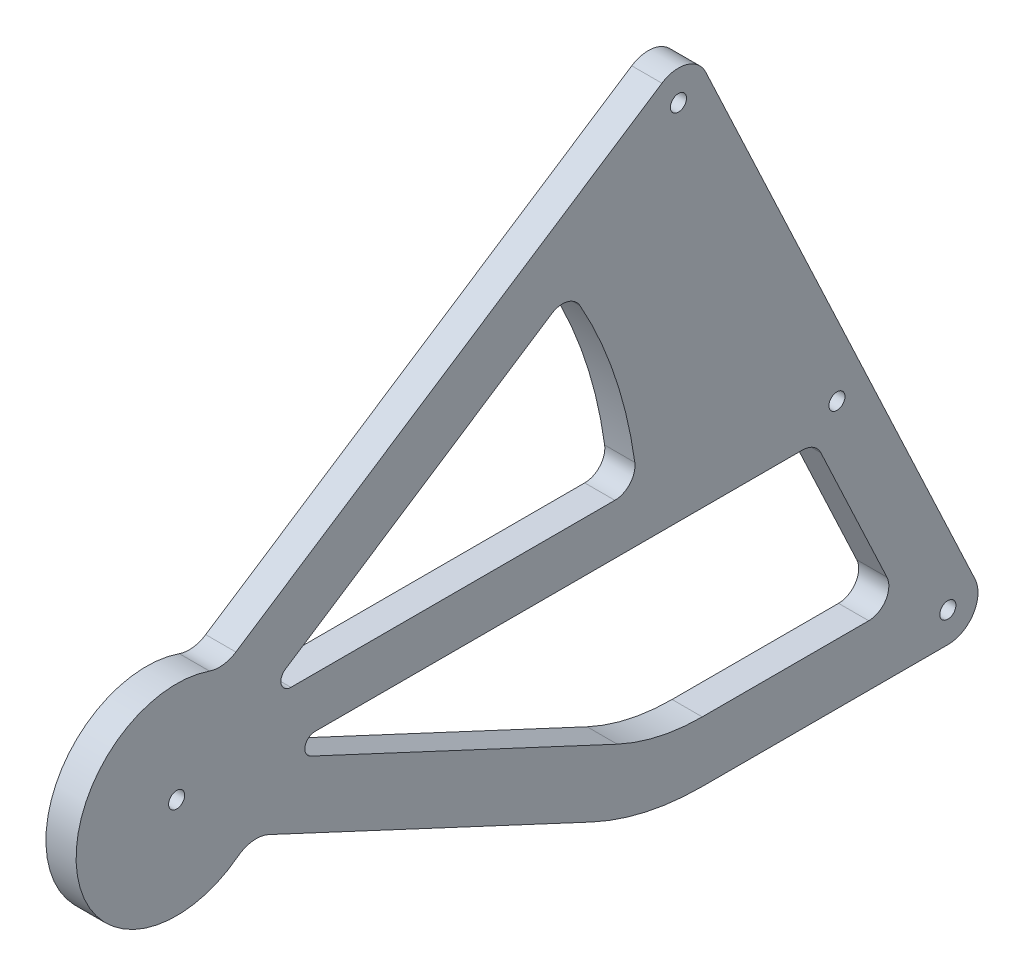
ISO-10303-21;
HEADER;
FILE_DESCRIPTION(('STEP AP214'),'2;1');
FILE_NAME('part.step','',(''),(''),'','','');
FILE_SCHEMA(('AUTOMOTIVE_DESIGN { 1 0 10303 214 1 1 1 1 }'));
ENDSEC;
DATA;
#1=APPLICATION_CONTEXT('core data for automotive mechanical design processes');
#2=APPLICATION_PROTOCOL_DEFINITION('international standard','automotive_design',2000,#1);
#3=PRODUCT_CONTEXT('',#1,'mechanical');
#4=PRODUCT('Part','Part','',(#3));
#5=PRODUCT_RELATED_PRODUCT_CATEGORY('part','',(#4));
#6=PRODUCT_DEFINITION_FORMATION('','',#4);
#7=PRODUCT_DEFINITION_CONTEXT('part definition',#1,'design');
#8=PRODUCT_DEFINITION('design','',#6,#7);
#9=PRODUCT_DEFINITION_SHAPE('','',#8);
#10=(LENGTH_UNIT() NAMED_UNIT(*) SI_UNIT(.MILLI.,.METRE.));
#11=(NAMED_UNIT(*) PLANE_ANGLE_UNIT() SI_UNIT($,.RADIAN.));
#12=(NAMED_UNIT(*) SI_UNIT($,.STERADIAN.) SOLID_ANGLE_UNIT());
#13=UNCERTAINTY_MEASURE_WITH_UNIT(LENGTH_MEASURE(1.E-05),#10,'distance_accuracy_value','');
#14=(GEOMETRIC_REPRESENTATION_CONTEXT(3) GLOBAL_UNCERTAINTY_ASSIGNED_CONTEXT((#13)) GLOBAL_UNIT_ASSIGNED_CONTEXT((#10,
#11,#12)) REPRESENTATION_CONTEXT('',''));
#15=CARTESIAN_POINT('',(0.,0.,0.));
#16=DIRECTION('',(0.,0.,1.));
#17=DIRECTION('',(1.,0.,0.));
#18=AXIS2_PLACEMENT_3D('',#15,#16,#17);
#19=CARTESIAN_POINT('',(15.,9147.56718383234,-4265.58063130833));
#20=DIRECTION('',(0.,0.906307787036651,-0.422618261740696));
#21=DIRECTION('',(0.,0.422618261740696,0.906307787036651));
#22=AXIS2_PLACEMENT_3D('',#19,#20,#21);
#23=PLANE('',#22);
#24=DIRECTION('',(0.,-0.422618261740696,-0.906307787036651));
#25=VECTOR('',#24,1.);
#26=CARTESIAN_POINT('',(15.,9147.56718383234,-4265.58063130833));
#27=LINE('',#26,#25);
#28=CARTESIAN_POINT('',(15.,4531.6365922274,-14164.475729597));
#29=VERTEX_POINT('',#28);
#30=CARTESIAN_POINT('',(15.,4456.78055450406,-14325.0050205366));
#31=VERTEX_POINT('',#30);
#32=EDGE_CURVE('E264',#29,#31,#27,.T.);
#33=ORIENTED_EDGE('',*,*,#32,.F.);
#34=DIRECTION('',(1.,0.,0.));
#35=VECTOR('',#34,1.);
#36=CARTESIAN_POINT('',(0.,4531.6365922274,-14164.475729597));
#37=LINE('',#36,#35);
#38=CARTESIAN_POINT('',(0.,4531.6365922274,-14164.475729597));
#39=VERTEX_POINT('',#38);
#40=EDGE_CURVE('E343',#29,#39,#37,.F.);
#41=ORIENTED_EDGE('',*,*,#40,.T.);
#42=DIRECTION('',(0.,-0.422618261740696,-0.906307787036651));
#43=VECTOR('',#42,1.);
#44=CARTESIAN_POINT('',(0.,9147.56718383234,-4265.58063130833));
#45=LINE('',#44,#43);
#46=CARTESIAN_POINT('',(0.,4456.78055450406,-14325.0050205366));
#47=VERTEX_POINT('',#46);
#48=EDGE_CURVE('E322',#39,#47,#45,.T.);
#49=ORIENTED_EDGE('',*,*,#48,.T.);
#50=DIRECTION('',(-1.,0.,0.));
#51=VECTOR('',#50,1.);
#52=CARTESIAN_POINT('',(15.,4456.78055450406,-14325.0050205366));
#53=LINE('',#52,#51);
#54=EDGE_CURVE('E339',#31,#47,#53,.T.);
#55=ORIENTED_EDGE('',*,*,#54,.F.);
#56=EDGE_LOOP('',(#33,#41,#49,#55));
#57=FACE_BOUND('',#56,.T.);
#58=ADVANCED_FACE('F37',(#57),#23,.F.);
#59=CARTESIAN_POINT('',(15.,4574.60056681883,-14379.9453945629));
#60=DIRECTION('',(-1.,0.,0.));
#61=DIRECTION('',(0.,0.,1.));
#62=AXIS2_PLACEMENT_3D('',#59,#60,#61);
#63=CYLINDRICAL_SURFACE('',#62,130.000000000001);
#64=CARTESIAN_POINT('',(0.,4574.60056681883,-14379.9453945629));
#65=DIRECTION('',(1.,0.,0.));
#66=DIRECTION('',(0.,0.,-1.));
#67=AXIS2_PLACEMENT_3D('',#64,#65,#66);
#68=CIRCLE('',#67,130.000000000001);
#69=CARTESIAN_POINT('',(0.,4444.60056681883,-14379.9453945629));
#70=VERTEX_POINT('',#69);
#71=EDGE_CURVE('E324',#47,#70,#68,.T.);
#72=ORIENTED_EDGE('',*,*,#71,.T.);
#73=DIRECTION('',(-1.,0.,0.));
#74=VECTOR('',#73,1.);
#75=CARTESIAN_POINT('',(15.,4444.60056681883,-14379.9453945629));
#76=LINE('',#75,#74);
#77=CARTESIAN_POINT('',(15.,4444.60056681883,-14379.9453945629));
#78=VERTEX_POINT('',#77);
#79=EDGE_CURVE('E336',#78,#70,#76,.T.);
#80=ORIENTED_EDGE('',*,*,#79,.F.);
#81=CARTESIAN_POINT('',(15.,4574.60056681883,-14379.9453945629));
#82=DIRECTION('',(1.,0.,0.));
#83=DIRECTION('',(0.,0.,-1.));
#84=AXIS2_PLACEMENT_3D('',#81,#82,#83);
#85=CIRCLE('',#84,130.000000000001);
#86=EDGE_CURVE('E266',#31,#78,#85,.T.);
#87=ORIENTED_EDGE('',*,*,#86,.F.);
#88=ORIENTED_EDGE('',*,*,#54,.T.);
#89=EDGE_LOOP('',(#72,#80,#87,#88));
#90=FACE_BOUND('',#89,.T.);
#91=ADVANCED_FACE('F422',(#90),#63,.T.);
#92=CARTESIAN_POINT('',(15.,4444.60056681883,0.));
#93=DIRECTION('',(0.,1.,0.));
#94=DIRECTION('',(0.,0.,1.));
#95=AXIS2_PLACEMENT_3D('',#92,#93,#94);
#96=PLANE('',#95);
#97=DIRECTION('',(0.,0.,-1.));
#98=VECTOR('',#97,1.);
#99=CARTESIAN_POINT('',(0.,4444.60056681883,0.));
#100=LINE('',#99,#98);
#101=CARTESIAN_POINT('',(0.,4444.60056681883,-14502.0941967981));
#102=VERTEX_POINT('',#101);
#103=EDGE_CURVE('E326',#70,#102,#100,.T.);
#104=ORIENTED_EDGE('',*,*,#103,.T.);
#105=DIRECTION('',(-1.,0.,0.));
#106=VECTOR('',#105,1.);
#107=CARTESIAN_POINT('',(15.,4444.60056681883,-14502.0941967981));
#108=LINE('',#107,#106);
#109=CARTESIAN_POINT('',(15.,4444.60056681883,-14502.0941967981));
#110=VERTEX_POINT('',#109);
#111=EDGE_CURVE('E52',#102,#110,#108,.F.);
#112=ORIENTED_EDGE('',*,*,#111,.T.);
#113=DIRECTION('',(0.,0.,-1.));
#114=VECTOR('',#113,1.);
#115=CARTESIAN_POINT('',(15.,4444.60056681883,0.));
#116=LINE('',#115,#114);
#117=EDGE_CURVE('E268',#78,#110,#116,.T.);
#118=ORIENTED_EDGE('',*,*,#117,.F.);
#119=ORIENTED_EDGE('',*,*,#79,.T.);
#120=EDGE_LOOP('',(#104,#112,#118,#119));
#121=FACE_BOUND('',#120,.T.);
#122=ADVANCED_FACE('F448',(#121),#96,.F.);
#123=CARTESIAN_POINT('',(15.,6390.02329246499,-13612.4779994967));
#124=DIRECTION('',(0.,0.42493399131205,-0.905224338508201));
#125=DIRECTION('',(0.,0.905224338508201,0.42493399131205));
#126=AXIS2_PLACEMENT_3D('',#123,#124,#125);
#127=PLANE('',#126);
#128=DIRECTION('',(0.,-0.905224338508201,-0.42493399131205));
#129=VECTOR('',#128,1.);
#130=CARTESIAN_POINT('',(0.,6390.02329246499,-13612.4779994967));
#131=LINE('',#130,#129);
#132=CARTESIAN_POINT('',(0.,4751.36103589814,-14381.7053208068));
#133=VERTEX_POINT('',#132);
#134=CARTESIAN_POINT('',(0.,4465.97457668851,-14515.6725618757));
#135=VERTEX_POINT('',#134);
#136=EDGE_CURVE('E328',#133,#135,#131,.T.);
#137=ORIENTED_EDGE('',*,*,#136,.F.);
#138=DIRECTION('',(-1.,0.,0.));
#139=VECTOR('',#138,1.);
#140=CARTESIAN_POINT('',(15.,4751.36103589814,-14381.7053208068));
#141=LINE('',#140,#139);
#142=CARTESIAN_POINT('',(15.,4751.36103589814,-14381.7053208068));
#143=VERTEX_POINT('',#142);
#144=EDGE_CURVE('E385',#133,#143,#141,.F.);
#145=ORIENTED_EDGE('',*,*,#144,.T.);
#146=DIRECTION('',(0.,-0.905224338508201,-0.42493399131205));
#147=VECTOR('',#146,1.);
#148=CARTESIAN_POINT('',(15.,6390.02329246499,-13612.4779994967));
#149=LINE('',#148,#147);
#150=CARTESIAN_POINT('',(15.,4465.97457668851,-14515.6725618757));
#151=VERTEX_POINT('',#150);
#152=EDGE_CURVE('E270',#143,#151,#149,.T.);
#153=ORIENTED_EDGE('',*,*,#152,.T.);
#154=DIRECTION('',(-1.,0.,0.));
#155=VECTOR('',#154,1.);
#156=CARTESIAN_POINT('',(0.,4465.97457668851,-14515.6725618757));
#157=LINE('',#156,#155);
#158=EDGE_CURVE('E382',#151,#135,#157,.T.);
#159=ORIENTED_EDGE('',*,*,#158,.T.);
#160=EDGE_LOOP('',(#137,#145,#153,#159));
#161=FACE_BOUND('',#160,.T.);
#162=ADVANCED_FACE('F428',(#161),#127,.T.);
#163=CARTESIAN_POINT('',(15.,-3261.01811935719,-2139.80590851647));
#164=DIRECTION('',(0.,0.836075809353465,0.548613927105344));
#165=DIRECTION('',(0.,-0.548613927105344,0.836075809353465));
#166=AXIS2_PLACEMENT_3D('',#163,#164,#165);
#167=PLANE('',#166);
#168=DIRECTION('',(0.,0.548613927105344,-0.836075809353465));
#169=VECTOR('',#168,1.);
#170=CARTESIAN_POINT('',(0.,-3261.01811935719,-2139.80590851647));
#171=LINE('',#170,#169);
#172=CARTESIAN_POINT('',(0.,4618.494719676,-14148.0137733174));
#173=VERTEX_POINT('',#172);
#174=CARTESIAN_POINT('',(0.,4757.52816316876,-14359.8977468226));
#175=VERTEX_POINT('',#174);
#176=EDGE_CURVE('E331',#173,#175,#171,.T.);
#177=ORIENTED_EDGE('',*,*,#176,.F.);
#178=DIRECTION('',(-1.,0.,0.));
#179=VECTOR('',#178,1.);
#180=CARTESIAN_POINT('',(15.,4618.494719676,-14148.0137733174));
#181=LINE('',#180,#179);
#182=CARTESIAN_POINT('',(15.,4618.494719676,-14148.0137733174));
#183=VERTEX_POINT('',#182);
#184=EDGE_CURVE('E376',#173,#183,#181,.F.);
#185=ORIENTED_EDGE('',*,*,#184,.T.);
#186=DIRECTION('',(0.,0.548613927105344,-0.836075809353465));
#187=VECTOR('',#186,1.);
#188=CARTESIAN_POINT('',(15.,-3261.01811935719,-2139.80590851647));
#189=LINE('',#188,#187);
#190=CARTESIAN_POINT('',(15.,4757.52816316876,-14359.8977468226));
#191=VERTEX_POINT('',#190);
#192=EDGE_CURVE('E272',#183,#191,#189,.T.);
#193=ORIENTED_EDGE('',*,*,#192,.T.);
#194=DIRECTION('',(-1.,0.,0.));
#195=VECTOR('',#194,1.);
#196=CARTESIAN_POINT('',(15.,4757.52816316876,-14359.8977468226));
#197=LINE('',#196,#195);
#198=EDGE_CURVE('E373',#191,#175,#197,.T.);
#199=ORIENTED_EDGE('',*,*,#198,.T.);
#200=EDGE_LOOP('',(#177,#185,#193,#199));
#201=FACE_BOUND('',#200,.T.);
#202=ADVANCED_FACE('F402',(#201),#167,.T.);
#203=CARTESIAN_POINT('',(15.,4559.60056681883,-14187.3238479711));
#204=DIRECTION('',(-1.,0.,0.));
#205=DIRECTION('',(0.,0.,1.));
#206=AXIS2_PLACEMENT_3D('',#203,#204,#205);
#207=CYLINDRICAL_SURFACE('',#206,4.9999999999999);
#208=CARTESIAN_POINT('',(0.,4559.60056681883,-14187.3238479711));
#209=DIRECTION('',(1.,0.,0.));
#210=DIRECTION('',(0.,0.,-1.));
#211=AXIS2_PLACEMENT_3D('',#208,#209,#210);
#212=CIRCLE('',#211,4.9999999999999);
#213=CARTESIAN_POINT('',(0.,4564.60056681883,-14187.3238479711));
#214=VERTEX_POINT('',#213);
#215=CARTESIAN_POINT('',(0.,4555.06902788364,-14185.2107566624));
#216=VERTEX_POINT('',#215);
#217=EDGE_CURVE('E298',#214,#216,#212,.T.);
#218=ORIENTED_EDGE('',*,*,#217,.F.);
#219=DIRECTION('',(-1.,0.,0.));
#220=VECTOR('',#219,1.);
#221=CARTESIAN_POINT('',(15.,4564.60056681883,-14187.3238479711));
#222=LINE('',#221,#220);
#223=CARTESIAN_POINT('',(15.,4564.60056681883,-14187.3238479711));
#224=VERTEX_POINT('',#223);
#225=EDGE_CURVE('E340',#224,#214,#222,.T.);
#226=ORIENTED_EDGE('',*,*,#225,.F.);
#227=CARTESIAN_POINT('',(15.,4559.60056681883,-14187.3238479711));
#228=DIRECTION('',(1.,0.,0.));
#229=DIRECTION('',(0.,0.,-1.));
#230=AXIS2_PLACEMENT_3D('',#227,#228,#229);
#231=CIRCLE('',#230,4.9999999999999);
#232=CARTESIAN_POINT('',(15.,4555.06902788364,-14185.2107566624));
#233=VERTEX_POINT('',#232);
#234=EDGE_CURVE('E242',#224,#233,#231,.T.);
#235=ORIENTED_EDGE('',*,*,#234,.T.);
#236=DIRECTION('',(-1.,0.,0.));
#237=VECTOR('',#236,1.);
#238=CARTESIAN_POINT('',(15.,4555.06902788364,-14185.2107566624));
#239=LINE('',#238,#237);
#240=EDGE_CURVE('E211',#233,#216,#239,.T.);
#241=ORIENTED_EDGE('',*,*,#240,.T.);
#242=EDGE_LOOP('',(#218,#226,#235,#241));
#243=FACE_BOUND('',#242,.T.);
#244=ADVANCED_FACE('F481',(#243),#207,.F.);
#245=CARTESIAN_POINT('',(15.,4564.60056681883,0.));
#246=DIRECTION('',(0.,1.,0.));
#247=DIRECTION('',(0.,0.,1.));
#248=AXIS2_PLACEMENT_3D('',#245,#246,#247);
#249=PLANE('',#248);
#250=DIRECTION('',(0.,0.,-1.));
#251=VECTOR('',#250,1.);
#252=CARTESIAN_POINT('',(0.,4564.60056681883,0.));
#253=LINE('',#252,#251);
#254=CARTESIAN_POINT('',(0.,4564.60056681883,-14429.8814574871));
#255=VERTEX_POINT('',#254);
#256=EDGE_CURVE('E301',#214,#255,#253,.T.);
#257=ORIENTED_EDGE('',*,*,#256,.T.);
#258=DIRECTION('',(-1.,0.,0.));
#259=VECTOR('',#258,1.);
#260=CARTESIAN_POINT('',(15.,4564.60056681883,-14429.8814574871));
#261=LINE('',#260,#259);
#262=CARTESIAN_POINT('',(15.,4564.60056681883,-14429.8814574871));
#263=VERTEX_POINT('',#262);
#264=EDGE_CURVE('E355',#263,#255,#261,.T.);
#265=ORIENTED_EDGE('',*,*,#264,.F.);
#266=DIRECTION('',(0.,0.,-1.));
#267=VECTOR('',#266,1.);
#268=CARTESIAN_POINT('',(15.,4564.60056681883,0.));
#269=LINE('',#268,#267);
#270=EDGE_CURVE('E245',#224,#263,#269,.T.);
#271=ORIENTED_EDGE('',*,*,#270,.F.);
#272=ORIENTED_EDGE('',*,*,#225,.T.);
#273=EDGE_LOOP('',(#257,#265,#271,#272));
#274=FACE_BOUND('',#273,.T.);
#275=ADVANCED_FACE('F477',(#274),#249,.F.);
#276=CARTESIAN_POINT('',(15.,4554.60056681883,-14429.8814574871));
#277=DIRECTION('',(-1.,0.,0.));
#278=DIRECTION('',(0.,0.,1.));
#279=AXIS2_PLACEMENT_3D('',#276,#277,#278);
#280=CYLINDRICAL_SURFACE('',#279,9.99999999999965);
#281=CARTESIAN_POINT('',(0.,4554.60056681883,-14429.8814574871));
#282=DIRECTION('',(1.,0.,0.));
#283=DIRECTION('',(0.,0.,-1.));
#284=AXIS2_PLACEMENT_3D('',#281,#282,#283);
#285=CIRCLE('',#284,9.99999999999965);
#286=CARTESIAN_POINT('',(0.,4558.84990673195,-14438.9337008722));
#287=VERTEX_POINT('',#286);
#288=EDGE_CURVE('E304',#287,#255,#285,.T.);
#289=ORIENTED_EDGE('',*,*,#288,.F.);
#290=DIRECTION('',(-1.,0.,0.));
#291=VECTOR('',#290,1.);
#292=CARTESIAN_POINT('',(15.,4558.84990673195,-14438.9337008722));
#293=LINE('',#292,#291);
#294=CARTESIAN_POINT('',(15.,4558.84990673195,-14438.9337008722));
#295=VERTEX_POINT('',#294);
#296=EDGE_CURVE('E353',#295,#287,#293,.T.);
#297=ORIENTED_EDGE('',*,*,#296,.F.);
#298=CARTESIAN_POINT('',(15.,4554.60056681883,-14429.8814574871));
#299=DIRECTION('',(1.,0.,0.));
#300=DIRECTION('',(0.,0.,-1.));
#301=AXIS2_PLACEMENT_3D('',#298,#299,#300);
#302=CIRCLE('',#301,9.99999999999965);
#303=EDGE_CURVE('E247',#295,#263,#302,.T.);
#304=ORIENTED_EDGE('',*,*,#303,.T.);
#305=ORIENTED_EDGE('',*,*,#264,.T.);
#306=EDGE_LOOP('',(#289,#297,#304,#305));
#307=FACE_BOUND('',#306,.T.);
#308=ADVANCED_FACE('F473',(#307),#280,.F.);
#309=CARTESIAN_POINT('',(15.,6377.27527272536,-13585.3212693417));
#310=DIRECTION('',(0.,0.424933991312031,-0.90522433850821));
#311=DIRECTION('',(0.,0.90522433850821,0.424933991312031));
#312=AXIS2_PLACEMENT_3D('',#309,#310,#311);
#313=PLANE('',#312);
#314=DIRECTION('',(0.,-0.90522433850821,-0.424933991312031));
#315=VECTOR('',#314,1.);
#316=CARTESIAN_POINT('',(0.,6377.27527272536,-13585.3212693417));
#317=LINE('',#316,#315);
#318=CARTESIAN_POINT('',(0.,4488.84990673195,-14471.7933778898));
#319=VERTEX_POINT('',#318);
#320=EDGE_CURVE('E307',#287,#319,#317,.T.);
#321=ORIENTED_EDGE('',*,*,#320,.T.);
#322=DIRECTION('',(-1.,0.,0.));
#323=VECTOR('',#322,1.);
#324=CARTESIAN_POINT('',(15.,4488.84990673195,-14471.7933778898));
#325=LINE('',#324,#323);
#326=CARTESIAN_POINT('',(15.,4488.84990673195,-14471.7933778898));
#327=VERTEX_POINT('',#326);
#328=EDGE_CURVE('E351',#327,#319,#325,.T.);
#329=ORIENTED_EDGE('',*,*,#328,.F.);
#330=DIRECTION('',(0.,-0.90522433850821,-0.424933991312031));
#331=VECTOR('',#330,1.);
#332=CARTESIAN_POINT('',(15.,6377.27527272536,-13585.3212693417));
#333=LINE('',#332,#331);
#334=EDGE_CURVE('E250',#295,#327,#333,.T.);
#335=ORIENTED_EDGE('',*,*,#334,.F.);
#336=ORIENTED_EDGE('',*,*,#296,.T.);
#337=EDGE_LOOP('',(#321,#329,#335,#336));
#338=FACE_BOUND('',#337,.T.);
#339=ADVANCED_FACE('F469',(#338),#313,.F.);
#340=CARTESIAN_POINT('',(15.,4484.60056681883,-14462.7411345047));
#341=DIRECTION('',(-1.,0.,0.));
#342=DIRECTION('',(0.,0.,1.));
#343=AXIS2_PLACEMENT_3D('',#340,#341,#342);
#344=CYLINDRICAL_SURFACE('',#343,9.99999999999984);
#345=CARTESIAN_POINT('',(0.,4484.60056681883,-14462.7411345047));
#346=DIRECTION('',(1.,0.,0.));
#347=DIRECTION('',(0.,0.,-1.));
#348=AXIS2_PLACEMENT_3D('',#345,#346,#347);
#349=CIRCLE('',#348,9.99999999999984);
#350=CARTESIAN_POINT('',(0.,4474.60056681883,-14462.7411345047));
#351=VERTEX_POINT('',#350);
#352=EDGE_CURVE('E310',#351,#319,#349,.T.);
#353=ORIENTED_EDGE('',*,*,#352,.F.);
#354=DIRECTION('',(-1.,0.,0.));
#355=VECTOR('',#354,1.);
#356=CARTESIAN_POINT('',(15.,4474.60056681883,-14462.7411345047));
#357=LINE('',#356,#355);
#358=CARTESIAN_POINT('',(15.,4474.60056681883,-14462.7411345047));
#359=VERTEX_POINT('',#358);
#360=EDGE_CURVE('E349',#359,#351,#357,.T.);
#361=ORIENTED_EDGE('',*,*,#360,.F.);
#362=CARTESIAN_POINT('',(15.,4484.60056681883,-14462.7411345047));
#363=DIRECTION('',(1.,0.,0.));
#364=DIRECTION('',(0.,0.,-1.));
#365=AXIS2_PLACEMENT_3D('',#362,#363,#364);
#366=CIRCLE('',#365,9.99999999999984);
#367=EDGE_CURVE('E252',#359,#327,#366,.T.);
#368=ORIENTED_EDGE('',*,*,#367,.T.);
#369=ORIENTED_EDGE('',*,*,#328,.T.);
#370=EDGE_LOOP('',(#353,#361,#368,#369));
#371=FACE_BOUND('',#370,.T.);
#372=ADVANCED_FACE('F465',(#371),#344,.F.);
#373=CARTESIAN_POINT('',(15.,4474.60056681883,0.));
#374=DIRECTION('',(0.,1.,0.));
#375=DIRECTION('',(0.,0.,1.));
#376=AXIS2_PLACEMENT_3D('',#373,#374,#375);
#377=PLANE('',#376);
#378=DIRECTION('',(0.,0.,-1.));
#379=VECTOR('',#378,1.);
#380=CARTESIAN_POINT('',(0.,4474.60056681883,0.));
#381=LINE('',#380,#379);
#382=CARTESIAN_POINT('',(0.,4474.60056681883,-14379.9453945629));
#383=VERTEX_POINT('',#382);
#384=EDGE_CURVE('E313',#383,#351,#381,.T.);
#385=ORIENTED_EDGE('',*,*,#384,.F.);
#386=DIRECTION('',(-1.,0.,0.));
#387=VECTOR('',#386,1.);
#388=CARTESIAN_POINT('',(15.,4474.60056681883,-14379.9453945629));
#389=LINE('',#388,#387);
#390=CARTESIAN_POINT('',(15.,4474.60056681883,-14379.9453945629));
#391=VERTEX_POINT('',#390);
#392=EDGE_CURVE('E347',#391,#383,#389,.T.);
#393=ORIENTED_EDGE('',*,*,#392,.F.);
#394=DIRECTION('',(0.,0.,-1.));
#395=VECTOR('',#394,1.);
#396=CARTESIAN_POINT('',(15.,4474.60056681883,0.));
#397=LINE('',#396,#395);
#398=EDGE_CURVE('E255',#391,#359,#397,.T.);
#399=ORIENTED_EDGE('',*,*,#398,.T.);
#400=ORIENTED_EDGE('',*,*,#360,.T.);
#401=EDGE_LOOP('',(#385,#393,#399,#400));
#402=FACE_BOUND('',#401,.T.);
#403=ADVANCED_FACE('F461',(#402),#377,.T.);
#404=CARTESIAN_POINT('',(15.,4574.60056681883,-14379.9453945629));
#405=DIRECTION('',(-1.,0.,0.));
#406=DIRECTION('',(0.,0.,1.));
#407=AXIS2_PLACEMENT_3D('',#404,#405,#406);
#408=CYLINDRICAL_SURFACE('',#407,100.000000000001);
#409=CARTESIAN_POINT('',(0.,4574.60056681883,-14379.9453945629));
#410=DIRECTION('',(1.,0.,0.));
#411=DIRECTION('',(0.,0.,-1.));
#412=AXIS2_PLACEMENT_3D('',#409,#410,#411);
#413=CIRCLE('',#412,100.000000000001);
#414=CARTESIAN_POINT('',(0.,4483.96978811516,-14337.6835683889));
#415=VERTEX_POINT('',#414);
#416=EDGE_CURVE('E316',#415,#383,#413,.T.);
#417=ORIENTED_EDGE('',*,*,#416,.F.);
#418=DIRECTION('',(-1.,0.,0.));
#419=VECTOR('',#418,1.);
#420=CARTESIAN_POINT('',(15.,4483.96978811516,-14337.6835683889));
#421=LINE('',#420,#419);
#422=CARTESIAN_POINT('',(15.,4483.96978811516,-14337.6835683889));
#423=VERTEX_POINT('',#422);
#424=EDGE_CURVE('E345',#423,#415,#421,.T.);
#425=ORIENTED_EDGE('',*,*,#424,.F.);
#426=CARTESIAN_POINT('',(15.,4574.60056681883,-14379.9453945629));
#427=DIRECTION('',(1.,0.,0.));
#428=DIRECTION('',(0.,0.,-1.));
#429=AXIS2_PLACEMENT_3D('',#426,#427,#428);
#430=CIRCLE('',#429,100.000000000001);
#431=EDGE_CURVE('E258',#423,#391,#430,.T.);
#432=ORIENTED_EDGE('',*,*,#431,.T.);
#433=ORIENTED_EDGE('',*,*,#392,.T.);
#434=EDGE_LOOP('',(#417,#425,#432,#433));
#435=FACE_BOUND('',#434,.T.);
#436=ADVANCED_FACE('F458',(#435),#408,.F.);
#437=CARTESIAN_POINT('',(15.,4594.60056681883,-14175.3967398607));
#438=DIRECTION('',(-1.,0.,0.));
#439=DIRECTION('',(0.,0.,1.));
#440=AXIS2_PLACEMENT_3D('',#437,#438,#439);
#441=CYLINDRICAL_SURFACE('',#440,4.99999999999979);
#442=CARTESIAN_POINT('',(0.,4594.60056681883,-14175.3967398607));
#443=DIRECTION('',(1.,0.,0.));
#444=DIRECTION('',(0.,0.,-1.));
#445=AXIS2_PLACEMENT_3D('',#442,#443,#444);
#446=CIRCLE('',#445,4.99999999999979);
#447=CARTESIAN_POINT('',(0.,4598.78094586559,-14172.6536702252));
#448=VERTEX_POINT('',#447);
#449=CARTESIAN_POINT('',(0.,4589.60056681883,-14175.3967398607));
#450=VERTEX_POINT('',#449);
#451=EDGE_CURVE('E207',#448,#450,#446,.T.);
#452=ORIENTED_EDGE('',*,*,#451,.F.);
#453=DIRECTION('',(-1.,0.,0.));
#454=VECTOR('',#453,1.);
#455=CARTESIAN_POINT('',(15.,4598.78094586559,-14172.6536702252));
#456=LINE('',#455,#454);
#457=CARTESIAN_POINT('',(15.,4598.78094586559,-14172.6536702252));
#458=VERTEX_POINT('',#457);
#459=EDGE_CURVE('E200',#458,#448,#456,.T.);
#460=ORIENTED_EDGE('',*,*,#459,.F.);
#461=CARTESIAN_POINT('',(15.,4594.60056681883,-14175.3967398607));
#462=DIRECTION('',(1.,0.,0.));
#463=DIRECTION('',(0.,0.,-1.));
#464=AXIS2_PLACEMENT_3D('',#461,#462,#463);
#465=CIRCLE('',#464,4.99999999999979);
#466=CARTESIAN_POINT('',(15.,4589.60056681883,-14175.3967398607));
#467=VERTEX_POINT('',#466);
#468=EDGE_CURVE('E204',#458,#467,#465,.T.);
#469=ORIENTED_EDGE('',*,*,#468,.T.);
#470=DIRECTION('',(-1.,0.,0.));
#471=VECTOR('',#470,1.);
#472=CARTESIAN_POINT('',(15.,4589.60056681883,-14175.3967398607));
#473=LINE('',#472,#471);
#474=EDGE_CURVE('E278',#467,#450,#473,.T.);
#475=ORIENTED_EDGE('',*,*,#474,.T.);
#476=EDGE_LOOP('',(#452,#460,#469,#475));
#477=FACE_BOUND('',#476,.T.);
#478=ADVANCED_FACE('F202',(#477),#441,.F.);
#479=CARTESIAN_POINT('',(15.,-3286.10039363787,-2156.26432632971));
#480=DIRECTION('',(0.,0.836075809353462,0.54861392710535));
#481=DIRECTION('',(0.,-0.54861392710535,0.836075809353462));
#482=AXIS2_PLACEMENT_3D('',#479,#480,#481);
#483=PLANE('',#482);
#484=DIRECTION('',(0.,0.54861392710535,-0.836075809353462));
#485=VECTOR('',#484,1.);
#486=CARTESIAN_POINT('',(0.,-3286.10039363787,-2156.26432632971));
#487=LINE('',#486,#485);
#488=CARTESIAN_POINT('',(0.,4685.58757589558,-14304.9451048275));
#489=VERTEX_POINT('',#488);
#490=EDGE_CURVE('E284',#448,#489,#487,.T.);
#491=ORIENTED_EDGE('',*,*,#490,.T.);
#492=DIRECTION('',(-1.,0.,0.));
#493=VECTOR('',#492,1.);
#494=CARTESIAN_POINT('',(15.,4685.58757589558,-14304.9451048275));
#495=LINE('',#494,#493);
#496=CARTESIAN_POINT('',(15.,4685.58757589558,-14304.9451048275));
#497=VERTEX_POINT('',#496);
#498=EDGE_CURVE('E212',#497,#489,#495,.T.);
#499=ORIENTED_EDGE('',*,*,#498,.F.);
#500=DIRECTION('',(0.,0.54861392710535,-0.836075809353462));
#501=VECTOR('',#500,1.);
#502=CARTESIAN_POINT('',(15.,-3286.10039363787,-2156.26432632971));
#503=LINE('',#502,#501);
#504=EDGE_CURVE('E215',#458,#497,#503,.T.);
#505=ORIENTED_EDGE('',*,*,#504,.F.);
#506=ORIENTED_EDGE('',*,*,#459,.T.);
#507=EDGE_LOOP('',(#491,#499,#505,#506));
#508=FACE_BOUND('',#507,.T.);
#509=ADVANCED_FACE('F216',(#508),#483,.F.);
#510=CARTESIAN_POINT('',(15.,4677.22681780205,-14310.4312440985));
#511=DIRECTION('',(-1.,0.,0.));
#512=DIRECTION('',(0.,0.,1.));
#513=AXIS2_PLACEMENT_3D('',#510,#511,#512);
#514=CYLINDRICAL_SURFACE('',#513,10.0000000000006);
#515=CARTESIAN_POINT('',(0.,4677.22681780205,-14310.4312440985));
#516=DIRECTION('',(1.,0.,0.));
#517=DIRECTION('',(0.,0.,-1.));
#518=AXIS2_PLACEMENT_3D('',#515,#516,#517);
#519=CIRCLE('',#518,10.0000000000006);
#520=CARTESIAN_POINT('',(0.,4682.11892011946,-14319.1529030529));
#521=VERTEX_POINT('',#520);
#522=EDGE_CURVE('E286',#521,#489,#519,.T.);
#523=ORIENTED_EDGE('',*,*,#522,.F.);
#524=DIRECTION('',(-1.,0.,0.));
#525=VECTOR('',#524,1.);
#526=CARTESIAN_POINT('',(15.,4682.11892011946,-14319.1529030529));
#527=LINE('',#526,#525);
#528=CARTESIAN_POINT('',(15.,4682.11892011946,-14319.1529030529));
#529=VERTEX_POINT('',#528);
#530=EDGE_CURVE('E363',#529,#521,#527,.T.);
#531=ORIENTED_EDGE('',*,*,#530,.F.);
#532=CARTESIAN_POINT('',(15.,4677.22681780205,-14310.4312440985));
#533=DIRECTION('',(1.,0.,0.));
#534=DIRECTION('',(0.,0.,-1.));
#535=AXIS2_PLACEMENT_3D('',#532,#533,#534);
#536=CIRCLE('',#535,10.0000000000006);
#537=EDGE_CURVE('E220',#529,#497,#536,.T.);
#538=ORIENTED_EDGE('',*,*,#537,.T.);
#539=ORIENTED_EDGE('',*,*,#498,.T.);
#540=EDGE_LOOP('',(#523,#531,#538,#539));
#541=FACE_BOUND('',#540,.T.);
#542=ADVANCED_FACE('F496',(#541),#514,.F.);
#543=CARTESIAN_POINT('',(15.,4569.60056681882,-14118.5547471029));
#544=DIRECTION('',(-1.,0.,0.));
#545=DIRECTION('',(0.,0.,1.));
#546=AXIS2_PLACEMENT_3D('',#543,#544,#545);
#547=CYLINDRICAL_SURFACE('',#546,229.999999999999);
#548=CARTESIAN_POINT('',(0.,4569.60056681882,-14118.5547471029));
#549=DIRECTION('',(1.,0.,0.));
#550=DIRECTION('',(0.,0.,-1.));
#551=AXIS2_PLACEMENT_3D('',#548,#549,#550);
#552=CIRCLE('',#551,229.999999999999);
#553=CARTESIAN_POINT('',(0.,4600.96420318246,-14346.406282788));
#554=VERTEX_POINT('',#553);
#555=EDGE_CURVE('E289',#554,#521,#552,.T.);
#556=ORIENTED_EDGE('',*,*,#555,.F.);
#557=DIRECTION('',(-1.,0.,0.));
#558=VECTOR('',#557,1.);
#559=CARTESIAN_POINT('',(15.,4600.96420318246,-14346.406282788));
#560=LINE('',#559,#558);
#561=CARTESIAN_POINT('',(15.,4600.96420318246,-14346.406282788));
#562=VERTEX_POINT('',#561);
#563=EDGE_CURVE('E361',#562,#554,#560,.T.);
#564=ORIENTED_EDGE('',*,*,#563,.F.);
#565=CARTESIAN_POINT('',(15.,4569.60056681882,-14118.5547471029));
#566=DIRECTION('',(1.,0.,0.));
#567=DIRECTION('',(0.,0.,-1.));
#568=AXIS2_PLACEMENT_3D('',#565,#566,#567);
#569=CIRCLE('',#568,229.999999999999);
#570=EDGE_CURVE('E235',#562,#529,#569,.T.);
#571=ORIENTED_EDGE('',*,*,#570,.T.);
#572=ORIENTED_EDGE('',*,*,#530,.T.);
#573=EDGE_LOOP('',(#556,#564,#571,#572));
#574=FACE_BOUND('',#573,.T.);
#575=ADVANCED_FACE('F492',(#574),#547,.F.);
#576=CARTESIAN_POINT('',(15.,4599.60056681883,-14336.49969428));
#577=DIRECTION('',(-1.,0.,0.));
#578=DIRECTION('',(0.,0.,1.));
#579=AXIS2_PLACEMENT_3D('',#576,#577,#578);
#580=CYLINDRICAL_SURFACE('',#579,9.99999999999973);
#581=CARTESIAN_POINT('',(0.,4599.60056681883,-14336.49969428));
#582=DIRECTION('',(1.,0.,0.));
#583=DIRECTION('',(0.,0.,-1.));
#584=AXIS2_PLACEMENT_3D('',#581,#582,#583);
#585=CIRCLE('',#584,9.99999999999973);
#586=CARTESIAN_POINT('',(0.,4589.60056681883,-14336.49969428));
#587=VERTEX_POINT('',#586);
#588=EDGE_CURVE('E292',#587,#554,#585,.T.);
#589=ORIENTED_EDGE('',*,*,#588,.F.);
#590=DIRECTION('',(-1.,0.,0.));
#591=VECTOR('',#590,1.);
#592=CARTESIAN_POINT('',(15.,4589.60056681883,-14336.49969428));
#593=LINE('',#592,#591);
#594=CARTESIAN_POINT('',(15.,4589.60056681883,-14336.49969428));
#595=VERTEX_POINT('',#594);
#596=EDGE_CURVE('E359',#595,#587,#593,.T.);
#597=ORIENTED_EDGE('',*,*,#596,.F.);
#598=CARTESIAN_POINT('',(15.,4599.60056681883,-14336.49969428));
#599=DIRECTION('',(1.,0.,0.));
#600=DIRECTION('',(0.,0.,-1.));
#601=AXIS2_PLACEMENT_3D('',#598,#599,#600);
#602=CIRCLE('',#601,9.99999999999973);
#603=EDGE_CURVE('E238',#595,#562,#602,.T.);
#604=ORIENTED_EDGE('',*,*,#603,.T.);
#605=ORIENTED_EDGE('',*,*,#563,.T.);
#606=EDGE_LOOP('',(#589,#597,#604,#605));
#607=FACE_BOUND('',#606,.T.);
#608=ADVANCED_FACE('F456',(#607),#580,.F.);
#609=CARTESIAN_POINT('',(15.,9174.75641744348,-4278.25917916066));
#610=DIRECTION('',(0.,0.906307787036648,-0.422618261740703));
#611=DIRECTION('',(0.,0.422618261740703,0.906307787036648));
#612=AXIS2_PLACEMENT_3D('',#609,#610,#611);
#613=PLANE('',#612);
#614=DIRECTION('',(0.,-0.422618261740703,-0.906307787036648));
#615=VECTOR('',#614,1.);
#616=CARTESIAN_POINT('',(0.,9174.75641744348,-4278.25917916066));
#617=LINE('',#616,#615);
#618=EDGE_CURVE('E319',#216,#415,#617,.T.);
#619=ORIENTED_EDGE('',*,*,#618,.F.);
#620=ORIENTED_EDGE('',*,*,#240,.F.);
#621=DIRECTION('',(0.,-0.422618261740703,-0.906307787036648));
#622=VECTOR('',#621,1.);
#623=CARTESIAN_POINT('',(15.,9174.75641744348,-4278.25917916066));
#624=LINE('',#623,#622);
#625=EDGE_CURVE('E261',#233,#423,#624,.T.);
#626=ORIENTED_EDGE('',*,*,#625,.T.);
#627=ORIENTED_EDGE('',*,*,#424,.T.);
#628=EDGE_LOOP('',(#619,#620,#626,#627));
#629=FACE_BOUND('',#628,.T.);
#630=ADVANCED_FACE('F452',(#629),#613,.T.);
#631=CARTESIAN_POINT('',(15.,4589.60056681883,0.));
#632=DIRECTION('',(0.,1.,0.));
#633=DIRECTION('',(0.,0.,1.));
#634=AXIS2_PLACEMENT_3D('',#631,#632,#633);
#635=PLANE('',#634);
#636=DIRECTION('',(0.,0.,-1.));
#637=VECTOR('',#636,1.);
#638=CARTESIAN_POINT('',(0.,4589.60056681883,0.));
#639=LINE('',#638,#637);
#640=EDGE_CURVE('E295',#450,#587,#639,.T.);
#641=ORIENTED_EDGE('',*,*,#640,.F.);
#642=ORIENTED_EDGE('',*,*,#474,.F.);
#643=DIRECTION('',(0.,0.,-1.));
#644=VECTOR('',#643,1.);
#645=CARTESIAN_POINT('',(15.,4589.60056681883,0.));
#646=LINE('',#645,#644);
#647=EDGE_CURVE('E226',#467,#595,#646,.T.);
#648=ORIENTED_EDGE('',*,*,#647,.T.);
#649=ORIENTED_EDGE('',*,*,#596,.T.);
#650=EDGE_LOOP('',(#641,#642,#648,#649));
#651=FACE_BOUND('',#650,.T.);
#652=ADVANCED_FACE('F455',(#651),#635,.T.);
#653=CARTESIAN_POINT('',(15.,4569.60056681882,-14118.5547471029));
#654=DIRECTION('',(-1.,0.,0.));
#655=DIRECTION('',(0.,0.,1.));
#656=AXIS2_PLACEMENT_3D('',#653,#654,#655);
#657=CYLINDRICAL_SURFACE('',#656,3.99999999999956);
#658=CARTESIAN_POINT('',(15.,4569.60056681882,-14118.5547471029));
#659=DIRECTION('',(1.,0.,0.));
#660=DIRECTION('',(0.,0.,-1.));
#661=AXIS2_PLACEMENT_3D('',#658,#659,#660);
#662=CIRCLE('',#661,3.99999999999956);
#663=CARTESIAN_POINT('',(15.,4569.60056681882,-14122.5547471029));
#664=VERTEX_POINT('',#663);
#665=EDGE_CURVE('E227',#664,#664,#662,.T.);
#666=ORIENTED_EDGE('',*,*,#665,.T.);
#667=EDGE_LOOP('',(#666));
#668=FACE_BOUND('',#667,.T.);
#669=CARTESIAN_POINT('',(0.,4569.60056681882,-14118.5547471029));
#670=DIRECTION('',(1.,0.,0.));
#671=DIRECTION('',(0.,0.,-1.));
#672=AXIS2_PLACEMENT_3D('',#669,#670,#671);
#673=CIRCLE('',#672,3.99999999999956);
#674=CARTESIAN_POINT('',(0.,4569.60056681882,-14122.5547471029));
#675=VERTEX_POINT('',#674);
#676=EDGE_CURVE('E279',#675,#675,#673,.T.);
#677=ORIENTED_EDGE('',*,*,#676,.F.);
#678=EDGE_LOOP('',(#677));
#679=FACE_BOUND('',#678,.T.);
#680=ADVANCED_FACE('F488',(#668,#679),#657,.F.);
#681=CARTESIAN_POINT('',(15.,4569.60056681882,-14118.5547471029));
#682=DIRECTION('',(-1.,0.,0.));
#683=DIRECTION('',(0.,0.,1.));
#684=AXIS2_PLACEMENT_3D('',#681,#682,#683);
#685=CYLINDRICAL_SURFACE('',#684,49.9999999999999);
#686=CARTESIAN_POINT('',(0.,4569.60056681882,-14118.5547471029));
#687=DIRECTION('',(1.,0.,0.));
#688=DIRECTION('',(0.,0.,-1.));
#689=AXIS2_PLACEMENT_3D('',#686,#687,#688);
#690=CIRCLE('',#689,49.9999999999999);
#691=CARTESIAN_POINT('',(0.,4616.8584822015,-14134.8853758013));
#692=VERTEX_POINT('',#691);
#693=CARTESIAN_POINT('',(0.,4529.94011189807,-14149.0022152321));
#694=VERTEX_POINT('',#693);
#695=EDGE_CURVE('E230',#692,#694,#690,.T.);
#696=ORIENTED_EDGE('',*,*,#695,.T.);
#697=DIRECTION('',(-1.,0.,0.));
#698=VECTOR('',#697,1.);
#699=CARTESIAN_POINT('',(15.,4529.94011189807,-14149.0022152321));
#700=LINE('',#699,#698);
#701=CARTESIAN_POINT('',(15.,4529.94011189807,-14149.0022152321));
#702=VERTEX_POINT('',#701);
#703=EDGE_CURVE('E371',#694,#702,#700,.F.);
#704=ORIENTED_EDGE('',*,*,#703,.T.);
#705=CARTESIAN_POINT('',(15.,4569.60056681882,-14118.5547471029));
#706=DIRECTION('',(1.,0.,0.));
#707=DIRECTION('',(0.,0.,-1.));
#708=AXIS2_PLACEMENT_3D('',#705,#706,#707);
#709=CIRCLE('',#708,49.9999999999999);
#710=CARTESIAN_POINT('',(15.,4616.8584822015,-14134.8853758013));
#711=VERTEX_POINT('',#710);
#712=EDGE_CURVE('E275',#711,#702,#709,.T.);
#713=ORIENTED_EDGE('',*,*,#712,.F.);
#714=DIRECTION('',(-1.,0.,0.));
#715=VECTOR('',#714,1.);
#716=CARTESIAN_POINT('',(15.,4616.8584822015,-14134.8853758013));
#717=LINE('',#716,#715);
#718=EDGE_CURVE('E368',#711,#692,#717,.T.);
#719=ORIENTED_EDGE('',*,*,#718,.T.);
#720=EDGE_LOOP('',(#696,#704,#713,#719));
#721=FACE_BOUND('',#720,.T.);
#722=ADVANCED_FACE('F410',(#721),#685,.T.);
#723=CARTESIAN_POINT('',(15.,0.,0.));
#724=DIRECTION('',(1.,0.,0.));
#725=DIRECTION('',(0.,0.,-1.));
#726=AXIS2_PLACEMENT_3D('',#723,#724,#725);
#727=PLANE('',#726);
#728=CARTESIAN_POINT('',(15.,4577.10056681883,-14446.9368818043));
#729=DIRECTION('',(1.,0.,0.));
#730=DIRECTION('',(0.,0.,-1.));
#731=AXIS2_PLACEMENT_3D('',#728,#729,#730);
#732=CIRCLE('',#731,4.00000000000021);
#733=CARTESIAN_POINT('',(15.,4577.10056681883,-14450.9368818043));
#734=VERTEX_POINT('',#733);
#735=EDGE_CURVE('E717',#734,#734,#732,.T.);
#736=ORIENTED_EDGE('',*,*,#735,.F.);
#737=EDGE_LOOP('',(#736));
#738=FACE_BOUND('',#737,.T.);
#739=CARTESIAN_POINT('',(15.,4459.60056681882,-14502.0941967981));
#740=DIRECTION('',(1.,0.,0.));
#741=DIRECTION('',(0.,0.,-1.));
#742=AXIS2_PLACEMENT_3D('',#739,#740,#741);
#743=CIRCLE('',#742,4.00000000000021);
#744=CARTESIAN_POINT('',(15.,4459.60056681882,-14506.0941967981));
#745=VERTEX_POINT('',#744);
#746=EDGE_CURVE('E719',#745,#745,#743,.T.);
#747=ORIENTED_EDGE('',*,*,#746,.F.);
#748=EDGE_LOOP('',(#747));
#749=FACE_BOUND('',#748,.T.);
#750=CARTESIAN_POINT('',(15.,4744.98702602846,-14368.1269557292));
#751=DIRECTION('',(1.,0.,0.));
#752=DIRECTION('',(0.,0.,-1.));
#753=AXIS2_PLACEMENT_3D('',#750,#751,#752);
#754=CIRCLE('',#753,4.00000000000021);
#755=CARTESIAN_POINT('',(15.,4744.98702602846,-14372.1269557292));
#756=VERTEX_POINT('',#755);
#757=EDGE_CURVE('E725',#756,#756,#754,.T.);
#758=ORIENTED_EDGE('',*,*,#757,.F.);
#759=EDGE_LOOP('',(#758));
#760=FACE_BOUND('',#759,.T.);
#761=ORIENTED_EDGE('',*,*,#665,.F.);
#762=EDGE_LOOP('',(#761));
#763=FACE_BOUND('',#762,.T.);
#764=ORIENTED_EDGE('',*,*,#468,.F.);
#765=ORIENTED_EDGE('',*,*,#504,.T.);
#766=ORIENTED_EDGE('',*,*,#537,.F.);
#767=ORIENTED_EDGE('',*,*,#570,.F.);
#768=ORIENTED_EDGE('',*,*,#603,.F.);
#769=ORIENTED_EDGE('',*,*,#647,.F.);
#770=EDGE_LOOP('',(#764,#765,#766,#767,#768,#769));
#771=FACE_BOUND('',#770,.T.);
#772=ORIENTED_EDGE('',*,*,#234,.F.);
#773=ORIENTED_EDGE('',*,*,#270,.T.);
#774=ORIENTED_EDGE('',*,*,#303,.F.);
#775=ORIENTED_EDGE('',*,*,#334,.T.);
#776=ORIENTED_EDGE('',*,*,#367,.F.);
#777=ORIENTED_EDGE('',*,*,#398,.F.);
#778=ORIENTED_EDGE('',*,*,#431,.F.);
#779=ORIENTED_EDGE('',*,*,#625,.F.);
#780=EDGE_LOOP('',(#772,#773,#774,#775,#776,#777,#778,#779));
#781=FACE_BOUND('',#780,.T.);
#782=ORIENTED_EDGE('',*,*,#152,.F.);
#783=CARTESIAN_POINT('',(15.,4744.98702602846,-14368.1269557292));
#784=DIRECTION('',(1.,0.,0.));
#785=DIRECTION('',(0.,0.,-1.));
#786=AXIS2_PLACEMENT_3D('',#783,#784,#785);
#787=CIRCLE('',#786,15.);
#788=EDGE_CURVE('E388',#143,#191,#787,.T.);
#789=ORIENTED_EDGE('',*,*,#788,.T.);
#790=ORIENTED_EDGE('',*,*,#192,.F.);
#791=CARTESIAN_POINT('',(15.,4631.03585681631,-14139.7845644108));
#792=DIRECTION('',(1.,0.,0.));
#793=DIRECTION('',(0.,0.,-1.));
#794=AXIS2_PLACEMENT_3D('',#791,#792,#793);
#795=CIRCLE('',#794,15.);
#796=EDGE_CURVE('E11',#183,#711,#795,.F.);
#797=ORIENTED_EDGE('',*,*,#796,.T.);
#798=ORIENTED_EDGE('',*,*,#712,.T.);
#799=CARTESIAN_POINT('',(15.,4518.04197542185,-14158.1364556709));
#800=DIRECTION('',(1.,0.,0.));
#801=DIRECTION('',(0.,0.,-1.));
#802=AXIS2_PLACEMENT_3D('',#799,#800,#801);
#803=CIRCLE('',#802,15.);
#804=EDGE_CURVE('E393',#702,#29,#803,.F.);
#805=ORIENTED_EDGE('',*,*,#804,.T.);
#806=ORIENTED_EDGE('',*,*,#32,.T.);
#807=ORIENTED_EDGE('',*,*,#86,.T.);
#808=ORIENTED_EDGE('',*,*,#117,.T.);
#809=CARTESIAN_POINT('',(15.,4459.60056681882,-14502.0941967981));
#810=DIRECTION('',(1.,0.,0.));
#811=DIRECTION('',(0.,0.,-1.));
#812=AXIS2_PLACEMENT_3D('',#809,#810,#811);
#813=CIRCLE('',#812,15.);
#814=EDGE_CURVE('E59',#110,#151,#813,.T.);
#815=ORIENTED_EDGE('',*,*,#814,.T.);
#816=EDGE_LOOP('',(#782,#789,#790,#797,#798,#805,#806,#807,#808,#815));
#817=FACE_BOUND('',#816,.T.);
#818=ADVANCED_FACE('F222',(#738,#749,#760,#763,#771,#781,#817),#727,.T.);
#819=CARTESIAN_POINT('',(0.,0.,0.));
#820=DIRECTION('',(1.,0.,0.));
#821=DIRECTION('',(0.,0.,-1.));
#822=AXIS2_PLACEMENT_3D('',#819,#820,#821);
#823=PLANE('',#822);
#824=CARTESIAN_POINT('',(0.,4577.10056681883,-14446.9368818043));
#825=DIRECTION('',(1.,0.,0.));
#826=DIRECTION('',(0.,0.,-1.));
#827=AXIS2_PLACEMENT_3D('',#824,#825,#826);
#828=CIRCLE('',#827,4.00000000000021);
#829=CARTESIAN_POINT('',(0.,4577.10056681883,-14450.9368818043));
#830=VERTEX_POINT('',#829);
#831=EDGE_CURVE('E714',#830,#830,#828,.T.);
#832=ORIENTED_EDGE('',*,*,#831,.T.);
#833=EDGE_LOOP('',(#832));
#834=FACE_BOUND('',#833,.T.);
#835=CARTESIAN_POINT('',(0.,4459.60056681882,-14502.0941967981));
#836=DIRECTION('',(1.,0.,0.));
#837=DIRECTION('',(0.,0.,-1.));
#838=AXIS2_PLACEMENT_3D('',#835,#836,#837);
#839=CIRCLE('',#838,4.00000000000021);
#840=CARTESIAN_POINT('',(0.,4459.60056681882,-14506.0941967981));
#841=VERTEX_POINT('',#840);
#842=EDGE_CURVE('E722',#841,#841,#839,.T.);
#843=ORIENTED_EDGE('',*,*,#842,.T.);
#844=EDGE_LOOP('',(#843));
#845=FACE_BOUND('',#844,.T.);
#846=CARTESIAN_POINT('',(0.,4744.98702602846,-14368.1269557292));
#847=DIRECTION('',(1.,0.,0.));
#848=DIRECTION('',(0.,0.,-1.));
#849=AXIS2_PLACEMENT_3D('',#846,#847,#848);
#850=CIRCLE('',#849,4.00000000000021);
#851=CARTESIAN_POINT('',(0.,4744.98702602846,-14372.1269557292));
#852=VERTEX_POINT('',#851);
#853=EDGE_CURVE('E282',#852,#852,#850,.T.);
#854=ORIENTED_EDGE('',*,*,#853,.T.);
#855=EDGE_LOOP('',(#854));
#856=FACE_BOUND('',#855,.T.);
#857=ORIENTED_EDGE('',*,*,#676,.T.);
#858=EDGE_LOOP('',(#857));
#859=FACE_BOUND('',#858,.T.);
#860=ORIENTED_EDGE('',*,*,#451,.T.);
#861=ORIENTED_EDGE('',*,*,#640,.T.);
#862=ORIENTED_EDGE('',*,*,#588,.T.);
#863=ORIENTED_EDGE('',*,*,#555,.T.);
#864=ORIENTED_EDGE('',*,*,#522,.T.);
#865=ORIENTED_EDGE('',*,*,#490,.F.);
#866=EDGE_LOOP('',(#860,#861,#862,#863,#864,#865));
#867=FACE_BOUND('',#866,.T.);
#868=ORIENTED_EDGE('',*,*,#217,.T.);
#869=ORIENTED_EDGE('',*,*,#618,.T.);
#870=ORIENTED_EDGE('',*,*,#416,.T.);
#871=ORIENTED_EDGE('',*,*,#384,.T.);
#872=ORIENTED_EDGE('',*,*,#352,.T.);
#873=ORIENTED_EDGE('',*,*,#320,.F.);
#874=ORIENTED_EDGE('',*,*,#288,.T.);
#875=ORIENTED_EDGE('',*,*,#256,.F.);
#876=EDGE_LOOP('',(#868,#869,#870,#871,#872,#873,#874,#875));
#877=FACE_BOUND('',#876,.T.);
#878=ORIENTED_EDGE('',*,*,#176,.T.);
#879=CARTESIAN_POINT('',(0.,4744.98702602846,-14368.1269557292));
#880=DIRECTION('',(1.,0.,0.));
#881=DIRECTION('',(0.,0.,-1.));
#882=AXIS2_PLACEMENT_3D('',#879,#880,#881);
#883=CIRCLE('',#882,15.);
#884=EDGE_CURVE('E380',#175,#133,#883,.F.);
#885=ORIENTED_EDGE('',*,*,#884,.T.);
#886=ORIENTED_EDGE('',*,*,#136,.T.);
#887=CARTESIAN_POINT('',(0.,4459.60056681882,-14502.0941967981));
#888=DIRECTION('',(1.,0.,0.));
#889=DIRECTION('',(0.,0.,-1.));
#890=AXIS2_PLACEMENT_3D('',#887,#888,#889);
#891=CIRCLE('',#890,15.);
#892=EDGE_CURVE('E378',#135,#102,#891,.F.);
#893=ORIENTED_EDGE('',*,*,#892,.T.);
#894=ORIENTED_EDGE('',*,*,#103,.F.);
#895=ORIENTED_EDGE('',*,*,#71,.F.);
#896=ORIENTED_EDGE('',*,*,#48,.F.);
#897=CARTESIAN_POINT('',(0.,4518.04197542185,-14158.1364556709));
#898=DIRECTION('',(1.,0.,0.));
#899=DIRECTION('',(0.,0.,-1.));
#900=AXIS2_PLACEMENT_3D('',#897,#898,#899);
#901=CIRCLE('',#900,15.);
#902=EDGE_CURVE('E391',#39,#694,#901,.T.);
#903=ORIENTED_EDGE('',*,*,#902,.T.);
#904=ORIENTED_EDGE('',*,*,#695,.F.);
#905=CARTESIAN_POINT('',(0.,4631.03585681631,-14139.7845644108));
#906=DIRECTION('',(1.,0.,0.));
#907=DIRECTION('',(0.,0.,-1.));
#908=AXIS2_PLACEMENT_3D('',#905,#906,#907);
#909=CIRCLE('',#908,15.);
#910=EDGE_CURVE('E45',#692,#173,#909,.T.);
#911=ORIENTED_EDGE('',*,*,#910,.T.);
#912=EDGE_LOOP('',(#878,#885,#886,#893,#894,#895,#896,#903,#904,#911));
#913=FACE_BOUND('',#912,.T.);
#914=ADVANCED_FACE('F397',(#834,#845,#856,#859,#867,#877,#913),#823,.F.);
#915=CARTESIAN_POINT('',(15.,4518.04197542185,-14158.1364556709));
#916=DIRECTION('',(-1.,0.,0.));
#917=DIRECTION('',(0.,0.,1.));
#918=AXIS2_PLACEMENT_3D('',#915,#916,#917);
#919=CYLINDRICAL_SURFACE('',#918,15.);
#920=ORIENTED_EDGE('',*,*,#804,.F.);
#921=ORIENTED_EDGE('',*,*,#703,.F.);
#922=ORIENTED_EDGE('',*,*,#902,.F.);
#923=ORIENTED_EDGE('',*,*,#40,.F.);
#924=EDGE_LOOP('',(#920,#921,#922,#923));
#925=FACE_BOUND('',#924,.T.);
#926=ADVANCED_FACE('F413',(#925),#919,.F.);
#927=CARTESIAN_POINT('',(15.,4631.03585681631,-14139.7845644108));
#928=DIRECTION('',(-1.,0.,0.));
#929=DIRECTION('',(0.,0.,1.));
#930=AXIS2_PLACEMENT_3D('',#927,#928,#929);
#931=CYLINDRICAL_SURFACE('',#930,15.);
#932=ORIENTED_EDGE('',*,*,#796,.F.);
#933=ORIENTED_EDGE('',*,*,#184,.F.);
#934=ORIENTED_EDGE('',*,*,#910,.F.);
#935=ORIENTED_EDGE('',*,*,#718,.F.);
#936=EDGE_LOOP('',(#932,#933,#934,#935));
#937=FACE_BOUND('',#936,.T.);
#938=ADVANCED_FACE('F406',(#937),#931,.F.);
#939=CARTESIAN_POINT('',(15.,4744.98702602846,-14368.1269557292));
#940=DIRECTION('',(-1.,0.,0.));
#941=DIRECTION('',(0.,0.,1.));
#942=AXIS2_PLACEMENT_3D('',#939,#940,#941);
#943=CYLINDRICAL_SURFACE('',#942,15.);
#944=ORIENTED_EDGE('',*,*,#788,.F.);
#945=ORIENTED_EDGE('',*,*,#144,.F.);
#946=ORIENTED_EDGE('',*,*,#884,.F.);
#947=ORIENTED_EDGE('',*,*,#198,.F.);
#948=EDGE_LOOP('',(#944,#945,#946,#947));
#949=FACE_BOUND('',#948,.T.);
#950=ADVANCED_FACE('F433',(#949),#943,.T.);
#951=CARTESIAN_POINT('',(15.,4459.60056681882,-14502.0941967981));
#952=DIRECTION('',(1.,0.,0.));
#953=DIRECTION('',(0.,0.,-1.));
#954=AXIS2_PLACEMENT_3D('',#951,#952,#953);
#955=CYLINDRICAL_SURFACE('',#954,15.);
#956=ORIENTED_EDGE('',*,*,#814,.F.);
#957=ORIENTED_EDGE('',*,*,#111,.F.);
#958=ORIENTED_EDGE('',*,*,#892,.F.);
#959=ORIENTED_EDGE('',*,*,#158,.F.);
#960=EDGE_LOOP('',(#956,#957,#958,#959));
#961=FACE_BOUND('',#960,.T.);
#962=ADVANCED_FACE('F39',(#961),#955,.T.);
#963=CARTESIAN_POINT('',(0.,4744.98702602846,-14368.1269557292));
#964=DIRECTION('',(1.,0.,0.));
#965=DIRECTION('',(0.,0.,-1.));
#966=AXIS2_PLACEMENT_3D('',#963,#964,#965);
#967=CYLINDRICAL_SURFACE('',#966,4.00000000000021);
#968=ORIENTED_EDGE('',*,*,#853,.F.);
#969=EDGE_LOOP('',(#968));
#970=FACE_BOUND('',#969,.T.);
#971=ORIENTED_EDGE('',*,*,#757,.T.);
#972=EDGE_LOOP('',(#971));
#973=FACE_BOUND('',#972,.T.);
#974=ADVANCED_FACE('F439',(#970,#973),#967,.F.);
#975=CARTESIAN_POINT('',(0.,4459.60056681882,-14502.0941967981));
#976=DIRECTION('',(1.,0.,0.));
#977=DIRECTION('',(0.,0.,-1.));
#978=AXIS2_PLACEMENT_3D('',#975,#976,#977);
#979=CYLINDRICAL_SURFACE('',#978,4.00000000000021);
#980=ORIENTED_EDGE('',*,*,#842,.F.);
#981=EDGE_LOOP('',(#980));
#982=FACE_BOUND('',#981,.T.);
#983=ORIENTED_EDGE('',*,*,#746,.T.);
#984=EDGE_LOOP('',(#983));
#985=FACE_BOUND('',#984,.T.);
#986=ADVANCED_FACE('F689',(#982,#985),#979,.F.);
#987=CARTESIAN_POINT('',(0.,4577.10056681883,-14446.9368818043));
#988=DIRECTION('',(1.,0.,0.));
#989=DIRECTION('',(0.,0.,-1.));
#990=AXIS2_PLACEMENT_3D('',#987,#988,#989);
#991=CYLINDRICAL_SURFACE('',#990,4.00000000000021);
#992=ORIENTED_EDGE('',*,*,#831,.F.);
#993=EDGE_LOOP('',(#992));
#994=FACE_BOUND('',#993,.T.);
#995=ORIENTED_EDGE('',*,*,#735,.T.);
#996=EDGE_LOOP('',(#995));
#997=FACE_BOUND('',#996,.T.);
#998=ADVANCED_FACE('F695',(#994,#997),#991,.F.);
#999=CLOSED_SHELL('',(#58,#91,#122,#162,#202,#244,#275,#308,#339,#372,#403,#436,#478,#509,#542,
#575,#608,#630,#652,#680,#722,#818,#914,#926,#938,#950,#962,#974,#986,#998));
#1000=MANIFOLD_SOLID_BREP('B2',#999);
#1001=ADVANCED_BREP_SHAPE_REPRESENTATION('',(#18,#1000),#14);
#1002=SHAPE_DEFINITION_REPRESENTATION(#9,#1001);
ENDSEC;
END-ISO-10303-21;
